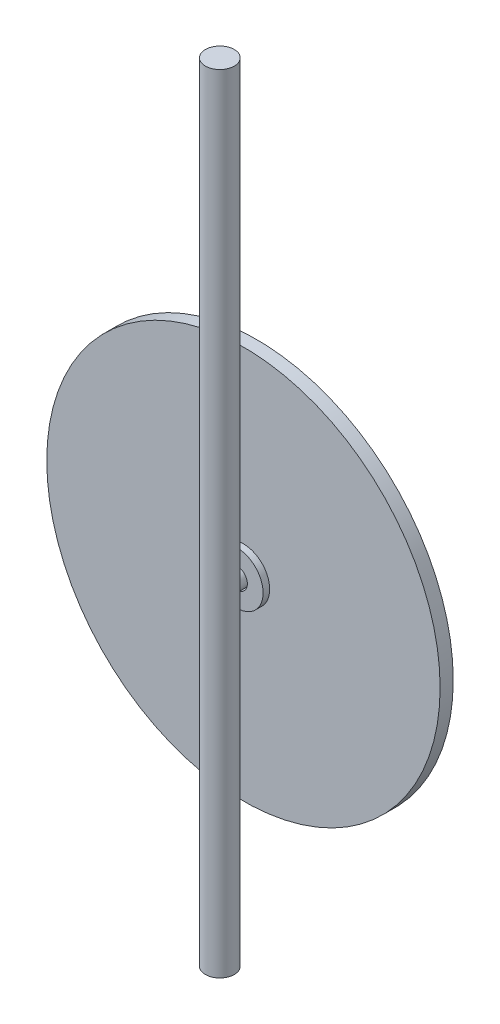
ISO-10303-21;
HEADER;
FILE_DESCRIPTION(('STEP AP214'),'2;1');
FILE_NAME('part.step','',(''),(''),'','','');
FILE_SCHEMA(('AUTOMOTIVE_DESIGN { 1 0 10303 214 1 1 1 1 }'));
ENDSEC;
DATA;
#1=APPLICATION_CONTEXT('core data for automotive mechanical design processes');
#2=APPLICATION_PROTOCOL_DEFINITION('international standard','automotive_design',2000,#1);
#3=PRODUCT_CONTEXT('',#1,'mechanical');
#4=PRODUCT('Part','Part','',(#3));
#5=PRODUCT_RELATED_PRODUCT_CATEGORY('part','',(#4));
#6=PRODUCT_DEFINITION_FORMATION('','',#4);
#7=PRODUCT_DEFINITION_CONTEXT('part definition',#1,'design');
#8=PRODUCT_DEFINITION('design','',#6,#7);
#9=PRODUCT_DEFINITION_SHAPE('','',#8);
#10=(LENGTH_UNIT() NAMED_UNIT(*) SI_UNIT(.MILLI.,.METRE.));
#11=(NAMED_UNIT(*) PLANE_ANGLE_UNIT() SI_UNIT($,.RADIAN.));
#12=(NAMED_UNIT(*) SI_UNIT($,.STERADIAN.) SOLID_ANGLE_UNIT());
#13=UNCERTAINTY_MEASURE_WITH_UNIT(LENGTH_MEASURE(1.E-05),#10,'distance_accuracy_value','');
#14=(GEOMETRIC_REPRESENTATION_CONTEXT(3) GLOBAL_UNCERTAINTY_ASSIGNED_CONTEXT((#13)) GLOBAL_UNIT_ASSIGNED_CONTEXT((#10,
#11,#12)) REPRESENTATION_CONTEXT('',''));
#15=CARTESIAN_POINT('',(0.,0.,0.));
#16=DIRECTION('',(0.,0.,1.));
#17=DIRECTION('',(1.,0.,0.));
#18=AXIS2_PLACEMENT_3D('',#15,#16,#17);
#19=CARTESIAN_POINT('',(99.9872894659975,-45.8993376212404,609.999999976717));
#20=DIRECTION('',(0.,0.,-1.));
#21=DIRECTION('',(-1.,0.,0.));
#22=AXIS2_PLACEMENT_3D('',#19,#20,#21);
#23=CYLINDRICAL_SURFACE('',#22,25.);
#24=CARTESIAN_POINT('',(99.9872894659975,-45.8993376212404,609.999999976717));
#25=DIRECTION('',(0.,0.,1.));
#26=DIRECTION('',(1.,0.,0.));
#27=AXIS2_PLACEMENT_3D('',#24,#25,#26);
#28=CIRCLE('',#27,25.);
#29=CARTESIAN_POINT('',(124.987289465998,-45.8993376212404,609.999999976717));
#30=VERTEX_POINT('',#29);
#31=EDGE_CURVE('P0_E12',#30,#30,#28,.T.);
#32=ORIENTED_EDGE('',*,*,#31,.F.);
#33=EDGE_LOOP('',(#32));
#34=FACE_BOUND('',#33,.T.);
#35=CARTESIAN_POINT('',(99.9872894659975,-45.8993376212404,599.999999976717));
#36=DIRECTION('',(0.,0.,1.));
#37=DIRECTION('',(1.,0.,0.));
#38=AXIS2_PLACEMENT_3D('',#35,#36,#37);
#39=CIRCLE('',#38,25.);
#40=CARTESIAN_POINT('',(124.987289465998,-45.8993376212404,599.999999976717));
#41=VERTEX_POINT('',#40);
#42=EDGE_CURVE('P0_E57',#41,#41,#39,.T.);
#43=ORIENTED_EDGE('',*,*,#42,.T.);
#44=EDGE_LOOP('',(#43));
#45=FACE_BOUND('',#44,.T.);
#46=ADVANCED_FACE('P0_F54',(#34,#45),#23,.T.);
#47=CARTESIAN_POINT('',(99.9872894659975,-45.8993376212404,609.999999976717));
#48=DIRECTION('',(0.,0.,1.));
#49=DIRECTION('',(1.,0.,0.));
#50=AXIS2_PLACEMENT_3D('',#47,#48,#49);
#51=PLANE('',#50);
#52=ORIENTED_EDGE('',*,*,#31,.T.);
#53=EDGE_LOOP('',(#52));
#54=FACE_BOUND('',#53,.T.);
#55=ADVANCED_FACE('P0_F83',(#54),#51,.T.);
#56=CARTESIAN_POINT('',(99.9872894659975,-45.8993376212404,560.121999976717));
#57=DIRECTION('',(0.,0.,1.));
#58=DIRECTION('',(1.,0.,0.));
#59=AXIS2_PLACEMENT_3D('',#56,#57,#58);
#60=CYLINDRICAL_SURFACE('',#59,59.944);
#61=CARTESIAN_POINT('',(99.9872894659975,-45.8993376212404,560.121999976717));
#62=DIRECTION('',(0.,0.,-1.));
#63=DIRECTION('',(-1.,0.,0.));
#64=AXIS2_PLACEMENT_3D('',#61,#62,#63);
#65=CIRCLE('',#64,59.944);
#66=CARTESIAN_POINT('',(40.0432894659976,-45.8993376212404,560.121999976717));
#67=VERTEX_POINT('',#66);
#68=EDGE_CURVE('P0_E68',#67,#67,#65,.T.);
#69=ORIENTED_EDGE('',*,*,#68,.F.);
#70=EDGE_LOOP('',(#69));
#71=FACE_BOUND('',#70,.T.);
#72=CARTESIAN_POINT('',(99.9872894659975,-45.8993376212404,599.999999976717));
#73=DIRECTION('',(0.,0.,-1.));
#74=DIRECTION('',(-1.,0.,0.));
#75=AXIS2_PLACEMENT_3D('',#72,#73,#74);
#76=CIRCLE('',#75,59.944);
#77=CARTESIAN_POINT('',(40.0432894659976,-45.8993376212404,599.999999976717));
#78=VERTEX_POINT('',#77);
#79=EDGE_CURVE('P0_E71',#78,#78,#76,.T.);
#80=ORIENTED_EDGE('',*,*,#79,.T.);
#81=EDGE_LOOP('',(#80));
#82=FACE_BOUND('',#81,.T.);
#83=ADVANCED_FACE('P0_F80',(#71,#82),#60,.T.);
#84=CARTESIAN_POINT('',(99.9872894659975,-45.8993376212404,560.121999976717));
#85=DIRECTION('',(0.,0.,-1.));
#86=DIRECTION('',(-1.,0.,0.));
#87=AXIS2_PLACEMENT_3D('',#84,#85,#86);
#88=PLANE('',#87);
#89=ORIENTED_EDGE('',*,*,#68,.T.);
#90=EDGE_LOOP('',(#89));
#91=FACE_BOUND('',#90,.T.);
#92=ADVANCED_FACE('P0_F78',(#91),#88,.T.);
#93=CARTESIAN_POINT('',(99.9872894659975,-45.8993376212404,599.999999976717));
#94=DIRECTION('',(0.,0.,-1.));
#95=DIRECTION('',(-1.,0.,0.));
#96=AXIS2_PLACEMENT_3D('',#93,#94,#95);
#97=PLANE('',#96);
#98=ORIENTED_EDGE('',*,*,#42,.F.);
#99=EDGE_LOOP('',(#98));
#100=FACE_BOUND('',#99,.T.);
#101=ORIENTED_EDGE('',*,*,#79,.F.);
#102=EDGE_LOOP('',(#101));
#103=FACE_BOUND('',#102,.T.);
#104=ADVANCED_FACE('P0_F87',(#100,#103),#97,.F.);
#105=CLOSED_SHELL('',(#46,#55,#83,#92,#104));
#106=MANIFOLD_SOLID_BREP('P0_B2',#105);
#107=CARTESIAN_POINT('',(99.9872894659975,-295.89933762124,637.999999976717));
#108=DIRECTION('',(0.,1.,0.));
#109=DIRECTION('',(0.,0.,1.));
#110=AXIS2_PLACEMENT_3D('',#107,#108,#109);
#111=CYLINDRICAL_SURFACE('',#110,11.);
#112=CARTESIAN_POINT('',(99.9872894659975,-295.89933762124,637.999999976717));
#113=DIRECTION('',(0.,1.,0.));
#114=DIRECTION('',(0.,0.,1.));
#115=AXIS2_PLACEMENT_3D('',#112,#113,#114);
#116=CIRCLE('',#115,11.);
#117=CARTESIAN_POINT('',(99.9872894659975,-295.89933762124,648.999999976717));
#118=VERTEX_POINT('',#117);
#119=EDGE_CURVE('P0_E52',#118,#118,#116,.T.);
#120=ORIENTED_EDGE('',*,*,#119,.T.);
#121=EDGE_LOOP('',(#120));
#122=FACE_BOUND('',#121,.T.);
#123=CARTESIAN_POINT('',(99.9872894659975,304.10066237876,637.999999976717));
#124=DIRECTION('',(0.,1.,0.));
#125=DIRECTION('',(0.,0.,1.));
#126=AXIS2_PLACEMENT_3D('',#123,#124,#125);
#127=CIRCLE('',#126,11.);
#128=CARTESIAN_POINT('',(99.9872894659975,304.10066237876,648.999999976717));
#129=VERTEX_POINT('',#128);
#130=EDGE_CURVE('P0_E153',#129,#129,#127,.T.);
#131=ORIENTED_EDGE('',*,*,#130,.F.);
#132=EDGE_LOOP('',(#131));
#133=FACE_BOUND('',#132,.T.);
#134=DIRECTION('',(0.,1.,0.));
#135=VECTOR('',#134,1.);
#136=CARTESIAN_POINT('',(92.4374550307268,-275.89933762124,629.999999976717));
#137=LINE('',#136,#135);
#138=CARTESIAN_POINT('',(92.4374550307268,-275.89933762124,629.999999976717));
#139=VERTEX_POINT('',#138);
#140=CARTESIAN_POINT('',(92.4374550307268,284.10066237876,629.999999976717));
#141=VERTEX_POINT('',#140);
#142=EDGE_CURVE('P0_E180',#139,#141,#137,.T.);
#143=ORIENTED_EDGE('',*,*,#142,.F.);
#144=CARTESIAN_POINT('',(99.9872894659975,-275.89933762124,637.999999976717));
#145=DIRECTION('',(0.,1.,0.));
#146=DIRECTION('',(0.,0.,1.));
#147=AXIS2_PLACEMENT_3D('',#144,#145,#146);
#148=CIRCLE('',#147,11.);
#149=CARTESIAN_POINT('',(107.537123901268,-275.89933762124,629.999999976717));
#150=VERTEX_POINT('',#149);
#151=EDGE_CURVE('P0_E182',#150,#139,#148,.T.);
#152=ORIENTED_EDGE('',*,*,#151,.F.);
#153=DIRECTION('',(0.,1.,0.));
#154=VECTOR('',#153,1.);
#155=CARTESIAN_POINT('',(107.537123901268,-275.89933762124,629.999999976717));
#156=LINE('',#155,#154);
#157=CARTESIAN_POINT('',(107.537123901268,284.10066237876,629.999999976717));
#158=VERTEX_POINT('',#157);
#159=EDGE_CURVE('P0_E167',#150,#158,#156,.T.);
#160=ORIENTED_EDGE('',*,*,#159,.T.);
#161=CARTESIAN_POINT('',(99.9872894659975,284.10066237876,637.999999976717));
#162=DIRECTION('',(0.,1.,0.));
#163=DIRECTION('',(0.,0.,1.));
#164=AXIS2_PLACEMENT_3D('',#161,#162,#163);
#165=CIRCLE('',#164,11.);
#166=EDGE_CURVE('P0_E173',#158,#141,#165,.T.);
#167=ORIENTED_EDGE('',*,*,#166,.T.);
#168=EDGE_LOOP('',(#143,#152,#160,#167));
#169=FACE_BOUND('',#168,.T.);
#170=ADVANCED_FACE('P0_F145',(#122,#133,#169),#111,.T.);
#171=CARTESIAN_POINT('',(110.987289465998,-295.89933762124,637.999999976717));
#172=DIRECTION('',(0.,-1.,0.));
#173=DIRECTION('',(0.,0.,-1.));
#174=AXIS2_PLACEMENT_3D('',#171,#172,#173);
#175=PLANE('',#174);
#176=ORIENTED_EDGE('',*,*,#119,.F.);
#177=EDGE_LOOP('',(#176));
#178=FACE_BOUND('',#177,.T.);
#179=ADVANCED_FACE('P0_F207',(#178),#175,.T.);
#180=CARTESIAN_POINT('',(99.9872894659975,304.10066237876,637.999999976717));
#181=DIRECTION('',(0.,1.,0.));
#182=DIRECTION('',(0.,0.,1.));
#183=AXIS2_PLACEMENT_3D('',#180,#181,#182);
#184=PLANE('',#183);
#185=ORIENTED_EDGE('',*,*,#130,.T.);
#186=EDGE_LOOP('',(#185));
#187=FACE_BOUND('',#186,.T.);
#188=ADVANCED_FACE('P0_F204',(#187),#184,.T.);
#189=CARTESIAN_POINT('',(92.4374550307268,-275.89933762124,629.999999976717));
#190=DIRECTION('',(0.,0.,1.));
#191=DIRECTION('',(1.,0.,0.));
#192=AXIS2_PLACEMENT_3D('',#189,#190,#191);
#193=PLANE('',#192);
#194=DIRECTION('',(1.,0.,0.));
#195=VECTOR('',#194,1.);
#196=CARTESIAN_POINT('',(92.4374550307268,284.10066237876,629.999999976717));
#197=LINE('',#196,#195);
#198=EDGE_CURVE('P0_E159',#141,#158,#197,.T.);
#199=ORIENTED_EDGE('',*,*,#198,.T.);
#200=ORIENTED_EDGE('',*,*,#159,.F.);
#201=DIRECTION('',(1.,0.,0.));
#202=VECTOR('',#201,1.);
#203=CARTESIAN_POINT('',(92.4374550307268,-275.89933762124,629.999999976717));
#204=LINE('',#203,#202);
#205=EDGE_CURVE('P0_E190',#139,#150,#204,.T.);
#206=ORIENTED_EDGE('',*,*,#205,.F.);
#207=ORIENTED_EDGE('',*,*,#142,.T.);
#208=EDGE_LOOP('',(#199,#200,#206,#207));
#209=FACE_BOUND('',#208,.T.);
#210=ADVANCED_FACE('P0_F179',(#209),#193,.F.);
#211=CARTESIAN_POINT('',(99.9872894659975,-275.89933762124,637.999999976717));
#212=DIRECTION('',(0.,1.,0.));
#213=DIRECTION('',(0.,0.,1.));
#214=AXIS2_PLACEMENT_3D('',#211,#212,#213);
#215=PLANE('',#214);
#216=ORIENTED_EDGE('',*,*,#151,.T.);
#217=ORIENTED_EDGE('',*,*,#205,.T.);
#218=EDGE_LOOP('',(#216,#217));
#219=FACE_BOUND('',#218,.T.);
#220=ADVANCED_FACE('P0_F197',(#219),#215,.T.);
#221=CARTESIAN_POINT('',(99.9872894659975,284.10066237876,637.999999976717));
#222=DIRECTION('',(0.,1.,0.));
#223=DIRECTION('',(0.,0.,1.));
#224=AXIS2_PLACEMENT_3D('',#221,#222,#223);
#225=PLANE('',#224);
#226=ORIENTED_EDGE('',*,*,#166,.F.);
#227=ORIENTED_EDGE('',*,*,#198,.F.);
#228=EDGE_LOOP('',(#226,#227));
#229=FACE_BOUND('',#228,.T.);
#230=ADVANCED_FACE('P0_F174',(#229),#225,.F.);
#231=CLOSED_SHELL('',(#170,#179,#188,#210,#220,#230));
#232=MANIFOLD_SOLID_BREP('P0_B7',#231);
#233=CARTESIAN_POINT('',(99.9872894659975,-45.8993376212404,619.999999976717));
#234=DIRECTION('',(0.,0.,1.));
#235=DIRECTION('',(1.,0.,0.));
#236=AXIS2_PLACEMENT_3D('',#233,#234,#235);
#237=CYLINDRICAL_SURFACE('',#236,6.);
#238=CARTESIAN_POINT('',(99.9872894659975,-45.8993376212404,619.999999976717));
#239=DIRECTION('',(0.,0.,-1.));
#240=DIRECTION('',(-1.,0.,0.));
#241=AXIS2_PLACEMENT_3D('',#238,#239,#240);
#242=CIRCLE('',#241,6.);
#243=CARTESIAN_POINT('',(93.9872894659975,-45.8993376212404,619.999999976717));
#244=VERTEX_POINT('',#243);
#245=EDGE_CURVE('P1_E11',#244,#244,#242,.T.);
#246=ORIENTED_EDGE('',*,*,#245,.F.);
#247=EDGE_LOOP('',(#246));
#248=FACE_BOUND('',#247,.T.);
#249=CARTESIAN_POINT('',(99.9872894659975,-45.8993376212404,629.999999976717));
#250=DIRECTION('',(0.,0.,-1.));
#251=DIRECTION('',(-1.,0.,0.));
#252=AXIS2_PLACEMENT_3D('',#249,#250,#251);
#253=CIRCLE('',#252,6.);
#254=CARTESIAN_POINT('',(93.9872894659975,-45.8993376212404,629.999999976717));
#255=VERTEX_POINT('',#254);
#256=EDGE_CURVE('P1_E20',#255,#255,#253,.T.);
#257=ORIENTED_EDGE('',*,*,#256,.T.);
#258=EDGE_LOOP('',(#257));
#259=FACE_BOUND('',#258,.T.);
#260=ADVANCED_FACE('P1_F17',(#248,#259),#237,.T.);
#261=CARTESIAN_POINT('',(99.9872894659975,-45.8993376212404,619.999999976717));
#262=DIRECTION('',(0.,0.,-1.));
#263=DIRECTION('',(-1.,0.,0.));
#264=AXIS2_PLACEMENT_3D('',#261,#262,#263);
#265=PLANE('',#264);
#266=ORIENTED_EDGE('',*,*,#245,.T.);
#267=EDGE_LOOP('',(#266));
#268=FACE_BOUND('',#267,.T.);
#269=ADVANCED_FACE('P1_F38',(#268),#265,.T.);
#270=CARTESIAN_POINT('',(99.9872894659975,-45.8993376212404,629.999999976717));
#271=DIRECTION('',(0.,0.,-1.));
#272=DIRECTION('',(-1.,0.,0.));
#273=AXIS2_PLACEMENT_3D('',#270,#271,#272);
#274=PLANE('',#273);
#275=ORIENTED_EDGE('',*,*,#256,.F.);
#276=EDGE_LOOP('',(#275));
#277=FACE_BOUND('',#276,.T.);
#278=ADVANCED_FACE('P1_F36',(#277),#274,.F.);
#279=CLOSED_SHELL('',(#260,#269,#278));
#280=MANIFOLD_SOLID_BREP('P1_B1',#279);
#281=CARTESIAN_POINT('',(99.9872894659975,-45.8993376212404,619.999999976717));
#282=DIRECTION('',(0.,0.,-1.));
#283=DIRECTION('',(-1.,0.,0.));
#284=AXIS2_PLACEMENT_3D('',#281,#282,#283);
#285=CYLINDRICAL_SURFACE('',#284,150.);
#286=CARTESIAN_POINT('',(99.9872894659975,-45.8993376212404,619.999999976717));
#287=DIRECTION('',(0.,0.,1.));
#288=DIRECTION('',(1.,0.,0.));
#289=AXIS2_PLACEMENT_3D('',#286,#287,#288);
#290=CIRCLE('',#289,150.);
#291=CARTESIAN_POINT('',(249.987289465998,-45.8993376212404,619.999999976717));
#292=VERTEX_POINT('',#291);
#293=EDGE_CURVE('P2_E11',#292,#292,#290,.T.);
#294=ORIENTED_EDGE('',*,*,#293,.F.);
#295=EDGE_LOOP('',(#294));
#296=FACE_BOUND('',#295,.T.);
#297=CARTESIAN_POINT('',(99.9872894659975,-45.8993376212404,609.999999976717));
#298=DIRECTION('',(0.,0.,1.));
#299=DIRECTION('',(1.,0.,0.));
#300=AXIS2_PLACEMENT_3D('',#297,#298,#299);
#301=CIRCLE('',#300,150.);
#302=CARTESIAN_POINT('',(249.987289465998,-45.8993376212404,609.999999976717));
#303=VERTEX_POINT('',#302);
#304=EDGE_CURVE('P2_E20',#303,#303,#301,.T.);
#305=ORIENTED_EDGE('',*,*,#304,.T.);
#306=EDGE_LOOP('',(#305));
#307=FACE_BOUND('',#306,.T.);
#308=ADVANCED_FACE('P2_F17',(#296,#307),#285,.T.);
#309=CARTESIAN_POINT('',(99.9872894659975,-45.8993376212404,619.999999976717));
#310=DIRECTION('',(0.,0.,1.));
#311=DIRECTION('',(1.,0.,0.));
#312=AXIS2_PLACEMENT_3D('',#309,#310,#311);
#313=PLANE('',#312);
#314=CARTESIAN_POINT('',(99.9872894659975,-45.8993376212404,619.999999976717));
#315=DIRECTION('',(0.,0.,1.));
#316=DIRECTION('',(1.,0.,0.));
#317=AXIS2_PLACEMENT_3D('',#314,#315,#316);
#318=CIRCLE('',#317,7.);
#319=CARTESIAN_POINT('',(106.987289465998,-45.8993376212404,619.999999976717));
#320=VERTEX_POINT('',#319);
#321=EDGE_CURVE('P2_E37',#320,#320,#318,.T.);
#322=ORIENTED_EDGE('',*,*,#321,.F.);
#323=EDGE_LOOP('',(#322));
#324=FACE_BOUND('',#323,.T.);
#325=ORIENTED_EDGE('',*,*,#293,.T.);
#326=EDGE_LOOP('',(#325));
#327=FACE_BOUND('',#326,.T.);
#328=ADVANCED_FACE('P2_F56',(#324,#327),#313,.T.);
#329=CARTESIAN_POINT('',(99.9872894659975,-45.8993376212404,609.999999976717));
#330=DIRECTION('',(0.,0.,1.));
#331=DIRECTION('',(1.,0.,0.));
#332=AXIS2_PLACEMENT_3D('',#329,#330,#331);
#333=PLANE('',#332);
#334=ORIENTED_EDGE('',*,*,#304,.F.);
#335=EDGE_LOOP('',(#334));
#336=FACE_BOUND('',#335,.T.);
#337=ADVANCED_FACE('P2_F52',(#336),#333,.F.);
#338=CARTESIAN_POINT('',(99.9872894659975,-45.8993376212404,614.999999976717));
#339=DIRECTION('',(0.,0.,1.));
#340=DIRECTION('',(1.,0.,0.));
#341=AXIS2_PLACEMENT_3D('',#338,#339,#340);
#342=CYLINDRICAL_SURFACE('',#341,7.);
#343=CARTESIAN_POINT('',(99.9872894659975,-45.8993376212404,614.999999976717));
#344=DIRECTION('',(0.,0.,1.));
#345=DIRECTION('',(1.,0.,0.));
#346=AXIS2_PLACEMENT_3D('',#343,#344,#345);
#347=CIRCLE('',#346,7.);
#348=CARTESIAN_POINT('',(106.987289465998,-45.8993376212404,614.999999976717));
#349=VERTEX_POINT('',#348);
#350=EDGE_CURVE('P2_E34',#349,#349,#347,.T.);
#351=ORIENTED_EDGE('',*,*,#350,.F.);
#352=EDGE_LOOP('',(#351));
#353=FACE_BOUND('',#352,.T.);
#354=ORIENTED_EDGE('',*,*,#321,.T.);
#355=EDGE_LOOP('',(#354));
#356=FACE_BOUND('',#355,.T.);
#357=ADVANCED_FACE('P2_F49',(#353,#356),#342,.F.);
#358=CARTESIAN_POINT('',(99.9872894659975,-45.8993376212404,614.999999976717));
#359=DIRECTION('',(0.,0.,1.));
#360=DIRECTION('',(1.,0.,0.));
#361=AXIS2_PLACEMENT_3D('',#358,#359,#360);
#362=PLANE('',#361);
#363=ORIENTED_EDGE('',*,*,#350,.T.);
#364=EDGE_LOOP('',(#363));
#365=FACE_BOUND('',#364,.T.);
#366=ADVANCED_FACE('P2_F47',(#365),#362,.T.);
#367=CLOSED_SHELL('',(#308,#328,#337,#357,#366));
#368=MANIFOLD_SOLID_BREP('P2_B1',#367);
#369=CARTESIAN_POINT('',(99.9872894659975,-45.8993376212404,624.999999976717));
#370=DIRECTION('',(0.,0.,1.));
#371=DIRECTION('',(1.,0.,0.));
#372=AXIS2_PLACEMENT_3D('',#369,#370,#371);
#373=PLANE('',#372);
#374=CARTESIAN_POINT('',(99.9872894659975,-45.8993376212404,624.999999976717));
#375=DIRECTION('',(0.,0.,1.));
#376=DIRECTION('',(1.,0.,0.));
#377=AXIS2_PLACEMENT_3D('',#374,#375,#376);
#378=CIRCLE('',#377,20.);
#379=CARTESIAN_POINT('',(119.987289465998,-45.8993376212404,624.999999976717));
#380=VERTEX_POINT('',#379);
#381=EDGE_CURVE('P3_E11',#380,#380,#378,.T.);
#382=ORIENTED_EDGE('',*,*,#381,.T.);
#383=EDGE_LOOP('',(#382));
#384=FACE_BOUND('',#383,.T.);
#385=CARTESIAN_POINT('',(99.9872894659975,-45.8993376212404,624.999999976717));
#386=DIRECTION('',(0.,0.,1.));
#387=DIRECTION('',(1.,0.,0.));
#388=AXIS2_PLACEMENT_3D('',#385,#386,#387);
#389=CIRCLE('',#388,8.);
#390=CARTESIAN_POINT('',(107.987289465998,-45.8993376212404,624.999999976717));
#391=VERTEX_POINT('',#390);
#392=EDGE_CURVE('P3_E33',#391,#391,#389,.T.);
#393=ORIENTED_EDGE('',*,*,#392,.F.);
#394=EDGE_LOOP('',(#393));
#395=FACE_BOUND('',#394,.T.);
#396=ADVANCED_FACE('P3_F17',(#384,#395),#373,.T.);
#397=CARTESIAN_POINT('',(99.9872894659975,-45.8993376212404,619.999999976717));
#398=DIRECTION('',(0.,0.,1.));
#399=DIRECTION('',(1.,0.,0.));
#400=AXIS2_PLACEMENT_3D('',#397,#398,#399);
#401=PLANE('',#400);
#402=CARTESIAN_POINT('',(99.9872894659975,-45.8993376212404,619.999999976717));
#403=DIRECTION('',(0.,0.,1.));
#404=DIRECTION('',(1.,0.,0.));
#405=AXIS2_PLACEMENT_3D('',#402,#403,#404);
#406=CIRCLE('',#405,20.);
#407=CARTESIAN_POINT('',(119.987289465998,-45.8993376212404,619.999999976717));
#408=VERTEX_POINT('',#407);
#409=EDGE_CURVE('P3_E21',#408,#408,#406,.T.);
#410=ORIENTED_EDGE('',*,*,#409,.F.);
#411=EDGE_LOOP('',(#410));
#412=FACE_BOUND('',#411,.T.);
#413=CARTESIAN_POINT('',(99.9872894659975,-45.8993376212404,619.999999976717));
#414=DIRECTION('',(0.,0.,1.));
#415=DIRECTION('',(1.,0.,0.));
#416=AXIS2_PLACEMENT_3D('',#413,#414,#415);
#417=CIRCLE('',#416,8.);
#418=CARTESIAN_POINT('',(107.987289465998,-45.8993376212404,619.999999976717));
#419=VERTEX_POINT('',#418);
#420=EDGE_CURVE('P3_E35',#419,#419,#417,.T.);
#421=ORIENTED_EDGE('',*,*,#420,.T.);
#422=EDGE_LOOP('',(#421));
#423=FACE_BOUND('',#422,.T.);
#424=ADVANCED_FACE('P3_F48',(#412,#423),#401,.F.);
#425=CARTESIAN_POINT('',(99.9872894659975,-45.8993376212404,624.999999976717));
#426=DIRECTION('',(0.,0.,-1.));
#427=DIRECTION('',(-1.,0.,0.));
#428=AXIS2_PLACEMENT_3D('',#425,#426,#427);
#429=CYLINDRICAL_SURFACE('',#428,20.);
#430=ORIENTED_EDGE('',*,*,#381,.F.);
#431=EDGE_LOOP('',(#430));
#432=FACE_BOUND('',#431,.T.);
#433=ORIENTED_EDGE('',*,*,#409,.T.);
#434=EDGE_LOOP('',(#433));
#435=FACE_BOUND('',#434,.T.);
#436=ADVANCED_FACE('P3_F19',(#432,#435),#429,.T.);
#437=CARTESIAN_POINT('',(99.9872894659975,-45.8993376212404,624.999999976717));
#438=DIRECTION('',(0.,0.,-1.));
#439=DIRECTION('',(-1.,0.,0.));
#440=AXIS2_PLACEMENT_3D('',#437,#438,#439);
#441=CYLINDRICAL_SURFACE('',#440,8.);
#442=ORIENTED_EDGE('',*,*,#392,.T.);
#443=EDGE_LOOP('',(#442));
#444=FACE_BOUND('',#443,.T.);
#445=ORIENTED_EDGE('',*,*,#420,.F.);
#446=EDGE_LOOP('',(#445));
#447=FACE_BOUND('',#446,.T.);
#448=ADVANCED_FACE('P3_F50',(#444,#447),#441,.F.);
#449=CLOSED_SHELL('',(#396,#424,#436,#448));
#450=MANIFOLD_SOLID_BREP('P3_B1',#449);
#451=CARTESIAN_POINT('',(99.9872894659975,-45.8993376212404,629.999999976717));
#452=DIRECTION('',(0.,0.,-1.));
#453=DIRECTION('',(-1.,0.,0.));
#454=AXIS2_PLACEMENT_3D('',#451,#452,#453);
#455=CYLINDRICAL_SURFACE('',#454,7.);
#456=CARTESIAN_POINT('',(99.9872894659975,-45.8993376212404,629.999999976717));
#457=DIRECTION('',(0.,0.,1.));
#458=DIRECTION('',(1.,0.,0.));
#459=AXIS2_PLACEMENT_3D('',#456,#457,#458);
#460=CIRCLE('',#459,7.);
#461=CARTESIAN_POINT('',(92.9872894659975,-45.8993376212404,629.999999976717));
#462=VERTEX_POINT('',#461);
#463=EDGE_CURVE('P4_E11',#462,#462,#460,.T.);
#464=CARTESIAN_POINT('',(99.9872894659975,-45.8993376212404,614.999999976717));
#465=DIRECTION('',(0.,0.,1.));
#466=DIRECTION('',(1.,0.,0.));
#467=AXIS2_PLACEMENT_3D('',#464,#465,#466);
#468=CIRCLE('',#467,7.);
#469=CARTESIAN_POINT('',(92.9872894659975,-45.8993376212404,614.999999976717));
#470=VERTEX_POINT('',#469);
#471=EDGE_CURVE('P4_E19',#470,#470,#468,.T.);
#472=CARTESIAN_POINT('',(92.9872894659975,-45.8993376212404,629.999999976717));
#473=CARTESIAN_POINT('',(92.9872894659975,-45.8993376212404,629.843749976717));
#474=CARTESIAN_POINT('',(92.9872894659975,-45.8993376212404,629.687499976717));
#475=CARTESIAN_POINT('',(92.9872894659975,-45.8993376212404,629.374999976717));
#476=CARTESIAN_POINT('',(92.9872894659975,-45.8993376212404,629.218749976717));
#477=CARTESIAN_POINT('',(92.9872894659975,-45.8993376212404,628.906249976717));
#478=CARTESIAN_POINT('',(92.9872894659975,-45.8993376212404,628.749999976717));
#479=CARTESIAN_POINT('',(92.9872894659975,-45.8993376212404,628.437499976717));
#480=CARTESIAN_POINT('',(92.9872894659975,-45.8993376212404,628.281249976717));
#481=CARTESIAN_POINT('',(92.9872894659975,-45.8993376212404,627.968749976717));
#482=CARTESIAN_POINT('',(92.9872894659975,-45.8993376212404,627.812499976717));
#483=CARTESIAN_POINT('',(92.9872894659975,-45.8993376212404,627.499999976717));
#484=CARTESIAN_POINT('',(92.9872894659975,-45.8993376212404,627.343749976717));
#485=CARTESIAN_POINT('',(92.9872894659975,-45.8993376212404,627.031249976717));
#486=CARTESIAN_POINT('',(92.9872894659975,-45.8993376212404,626.874999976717));
#487=CARTESIAN_POINT('',(92.9872894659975,-45.8993376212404,626.562499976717));
#488=CARTESIAN_POINT('',(92.9872894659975,-45.8993376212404,626.406249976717));
#489=CARTESIAN_POINT('',(92.9872894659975,-45.8993376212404,626.093749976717));
#490=CARTESIAN_POINT('',(92.9872894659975,-45.8993376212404,625.937499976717));
#491=CARTESIAN_POINT('',(92.9872894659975,-45.8993376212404,625.624999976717));
#492=CARTESIAN_POINT('',(92.9872894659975,-45.8993376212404,625.468749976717));
#493=CARTESIAN_POINT('',(92.9872894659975,-45.8993376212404,625.156249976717));
#494=CARTESIAN_POINT('',(92.9872894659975,-45.8993376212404,624.999999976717));
#495=CARTESIAN_POINT('',(92.9872894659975,-45.8993376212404,624.687499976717));
#496=CARTESIAN_POINT('',(92.9872894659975,-45.8993376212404,624.531249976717));
#497=CARTESIAN_POINT('',(92.9872894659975,-45.8993376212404,624.218749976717));
#498=CARTESIAN_POINT('',(92.9872894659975,-45.8993376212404,624.062499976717));
#499=CARTESIAN_POINT('',(92.9872894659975,-45.8993376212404,623.749999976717));
#500=CARTESIAN_POINT('',(92.9872894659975,-45.8993376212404,623.593749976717));
#501=CARTESIAN_POINT('',(92.9872894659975,-45.8993376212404,623.281249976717));
#502=CARTESIAN_POINT('',(92.9872894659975,-45.8993376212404,623.124999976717));
#503=CARTESIAN_POINT('',(92.9872894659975,-45.8993376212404,622.812499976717));
#504=CARTESIAN_POINT('',(92.9872894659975,-45.8993376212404,622.656249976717));
#505=CARTESIAN_POINT('',(92.9872894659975,-45.8993376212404,622.343749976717));
#506=CARTESIAN_POINT('',(92.9872894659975,-45.8993376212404,622.187499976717));
#507=CARTESIAN_POINT('',(92.9872894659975,-45.8993376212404,621.874999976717));
#508=CARTESIAN_POINT('',(92.9872894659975,-45.8993376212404,621.718749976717));
#509=CARTESIAN_POINT('',(92.9872894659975,-45.8993376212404,621.406249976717));
#510=CARTESIAN_POINT('',(92.9872894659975,-45.8993376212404,621.249999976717));
#511=CARTESIAN_POINT('',(92.9872894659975,-45.8993376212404,620.937499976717));
#512=CARTESIAN_POINT('',(92.9872894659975,-45.8993376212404,620.781249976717));
#513=CARTESIAN_POINT('',(92.9872894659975,-45.8993376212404,620.468749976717));
#514=CARTESIAN_POINT('',(92.9872894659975,-45.8993376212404,620.312499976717));
#515=CARTESIAN_POINT('',(92.9872894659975,-45.8993376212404,619.999999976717));
#516=CARTESIAN_POINT('',(92.9872894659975,-45.8993376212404,619.843749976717));
#517=CARTESIAN_POINT('',(92.9872894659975,-45.8993376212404,619.531249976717));
#518=CARTESIAN_POINT('',(92.9872894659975,-45.8993376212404,619.374999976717));
#519=CARTESIAN_POINT('',(92.9872894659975,-45.8993376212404,619.062499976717));
#520=CARTESIAN_POINT('',(92.9872894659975,-45.8993376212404,618.906249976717));
#521=CARTESIAN_POINT('',(92.9872894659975,-45.8993376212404,618.593749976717));
#522=CARTESIAN_POINT('',(92.9872894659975,-45.8993376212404,618.437499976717));
#523=CARTESIAN_POINT('',(92.9872894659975,-45.8993376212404,618.124999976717));
#524=CARTESIAN_POINT('',(92.9872894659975,-45.8993376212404,617.968749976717));
#525=CARTESIAN_POINT('',(92.9872894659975,-45.8993376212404,617.656249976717));
#526=CARTESIAN_POINT('',(92.9872894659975,-45.8993376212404,617.499999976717));
#527=CARTESIAN_POINT('',(92.9872894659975,-45.8993376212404,617.187499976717));
#528=CARTESIAN_POINT('',(92.9872894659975,-45.8993376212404,617.031249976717));
#529=CARTESIAN_POINT('',(92.9872894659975,-45.8993376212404,616.718749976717));
#530=CARTESIAN_POINT('',(92.9872894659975,-45.8993376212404,616.562499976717));
#531=CARTESIAN_POINT('',(92.9872894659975,-45.8993376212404,616.249999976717));
#532=CARTESIAN_POINT('',(92.9872894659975,-45.8993376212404,616.093749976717));
#533=CARTESIAN_POINT('',(92.9872894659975,-45.8993376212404,615.781249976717));
#534=CARTESIAN_POINT('',(92.9872894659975,-45.8993376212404,615.624999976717));
#535=CARTESIAN_POINT('',(92.9872894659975,-45.8993376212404,615.312499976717));
#536=CARTESIAN_POINT('',(92.9872894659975,-45.8993376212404,615.156249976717));
#537=CARTESIAN_POINT('',(92.9872894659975,-45.8993376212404,614.999999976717));
#538=B_SPLINE_CURVE_WITH_KNOTS('',3,(#472,#473,#474,#475,#476,#477,#478,#479,#480,#481,#482,
#483,#484,#485,#486,#487,#488,#489,#490,#491,#492,#493,#494,#495,#496,#497,#498,#499,#500,#501,
#502,#503,#504,#505,#506,#507,#508,#509,#510,#511,#512,#513,#514,#515,#516,#517,#518,#519,#520,
#521,#522,#523,#524,#525,#526,#527,#528,#529,#530,#531,#532,#533,#534,#535,#536,#537),
.UNSPECIFIED.,.F.,.F.,(4,2,2,2,2,2,2,2,2,2,2,2,2,2,2,2,2,2,2,2,2,2,2,2,2,2,2,2,2,2,2,2,4),(0.,
0.468749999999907,0.937499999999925,1.40624999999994,1.87499999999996,2.34374999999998,2.8125,
3.2812499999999,3.74999999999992,4.21874999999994,4.68749999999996,5.15624999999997,
5.62499999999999,6.0937499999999,6.56249999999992,7.03124999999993,7.49999999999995,
7.96874999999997,8.43749999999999,8.90625,9.37499999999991,9.84374999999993,10.3124999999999,
10.78125,11.25,11.71875,12.1874999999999,12.6562499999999,13.1249999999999,13.59375,14.0625,
14.53125,14.9999999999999),.UNSPECIFIED.);
#539=EDGE_CURVE('P4_BSEAM16',#462,#470,#538,.T.);
#540=ORIENTED_EDGE('',*,*,#463,.F.);
#541=ORIENTED_EDGE('',*,*,#471,.T.);
#542=ORIENTED_EDGE('',*,*,#539,.T.);
#543=ORIENTED_EDGE('',*,*,#539,.F.);
#544=EDGE_LOOP('',(#540,#542,#541,#543));
#545=FACE_BOUND('',#544,.T.);
#546=ADVANCED_FACE('P4_F16',(#545),#455,.T.);
#547=CARTESIAN_POINT('',(99.9872894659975,-45.8993376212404,629.999999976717));
#548=DIRECTION('',(0.,0.,1.));
#549=DIRECTION('',(1.,0.,0.));
#550=AXIS2_PLACEMENT_3D('',#547,#548,#549);
#551=PLANE('',#550);
#552=CARTESIAN_POINT('',(99.9872894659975,-45.8993376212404,629.999999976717));
#553=DIRECTION('',(0.,0.,1.));
#554=DIRECTION('',(1.,0.,0.));
#555=AXIS2_PLACEMENT_3D('',#552,#553,#554);
#556=CIRCLE('',#555,6.);
#557=CARTESIAN_POINT('',(105.987289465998,-45.8993376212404,629.999999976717));
#558=VERTEX_POINT('',#557);
#559=EDGE_CURVE('P4_E34',#558,#558,#556,.T.);
#560=ORIENTED_EDGE('',*,*,#559,.F.);
#561=EDGE_LOOP('',(#560));
#562=FACE_BOUND('',#561,.T.);
#563=ORIENTED_EDGE('',*,*,#463,.T.);
#564=EDGE_LOOP('',(#563));
#565=FACE_BOUND('',#564,.T.);
#566=ADVANCED_FACE('P4_F49',(#562,#565),#551,.T.);
#567=CARTESIAN_POINT('',(99.9872894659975,-45.8993376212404,614.999999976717));
#568=DIRECTION('',(0.,0.,1.));
#569=DIRECTION('',(1.,0.,0.));
#570=AXIS2_PLACEMENT_3D('',#567,#568,#569);
#571=PLANE('',#570);
#572=ORIENTED_EDGE('',*,*,#471,.F.);
#573=EDGE_LOOP('',(#572));
#574=FACE_BOUND('',#573,.T.);
#575=ADVANCED_FACE('P4_F51',(#574),#571,.F.);
#576=CARTESIAN_POINT('',(99.9872894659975,-45.8993376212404,619.999999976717));
#577=DIRECTION('',(0.,0.,1.));
#578=DIRECTION('',(1.,0.,0.));
#579=AXIS2_PLACEMENT_3D('',#576,#577,#578);
#580=CYLINDRICAL_SURFACE('',#579,6.);
#581=CARTESIAN_POINT('',(99.9872894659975,-45.8993376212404,619.999999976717));
#582=DIRECTION('',(0.,0.,1.));
#583=DIRECTION('',(1.,0.,0.));
#584=AXIS2_PLACEMENT_3D('',#581,#582,#583);
#585=CIRCLE('',#584,6.);
#586=CARTESIAN_POINT('',(105.987289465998,-45.8993376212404,619.999999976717));
#587=VERTEX_POINT('',#586);
#588=EDGE_CURVE('P4_E31',#587,#587,#585,.T.);
#589=ORIENTED_EDGE('',*,*,#588,.F.);
#590=EDGE_LOOP('',(#589));
#591=FACE_BOUND('',#590,.T.);
#592=ORIENTED_EDGE('',*,*,#559,.T.);
#593=EDGE_LOOP('',(#592));
#594=FACE_BOUND('',#593,.T.);
#595=ADVANCED_FACE('P4_F47',(#591,#594),#580,.F.);
#596=CARTESIAN_POINT('',(99.9872894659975,-45.8993376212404,619.999999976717));
#597=DIRECTION('',(0.,0.,1.));
#598=DIRECTION('',(1.,0.,0.));
#599=AXIS2_PLACEMENT_3D('',#596,#597,#598);
#600=PLANE('',#599);
#601=ORIENTED_EDGE('',*,*,#588,.T.);
#602=EDGE_LOOP('',(#601));
#603=FACE_BOUND('',#602,.T.);
#604=ADVANCED_FACE('P4_F62',(#603),#600,.T.);
#605=CLOSED_SHELL('',(#546,#566,#575,#595,#604));
#606=MANIFOLD_SOLID_BREP('P4_B1',#605);
#607=ADVANCED_BREP_SHAPE_REPRESENTATION('',(#18,#106,#232,#280,#368,#450,#606),#14);
#608=SHAPE_DEFINITION_REPRESENTATION(#9,#607);
ENDSEC;
END-ISO-10303-21;
